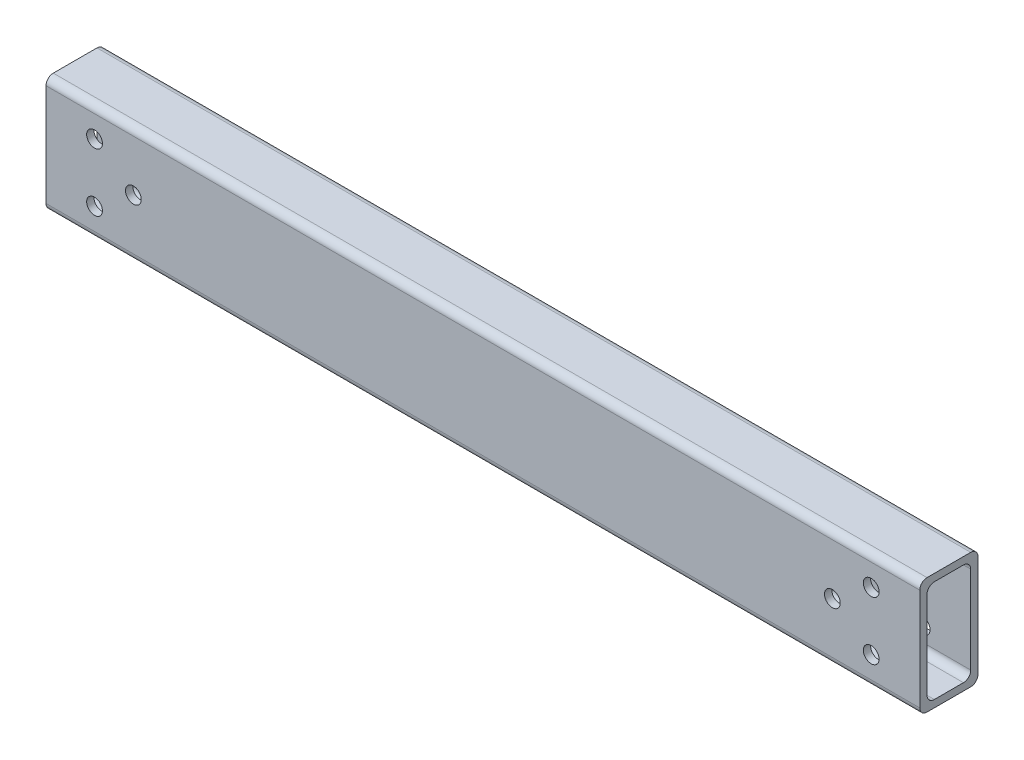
from build123d import *

# Parameters (mm, degrees)
SKETCH1_W               = 1143
SKETCH1_H               = 152.4
EXTRUDE1_DEPTH          = 76.2
SKETCH2_W               = 57.15
SKETCH2_H               = 133.35
CUT_EXTRUDE1_DEPTH      = 1143
FILLET1_R               = 9.525
SKETCH3_R               = 10.31875
CUT_EXTRUDE2_DEPTH      = 76.2
SKETCH6_R               = 10.31875
CUT_EXTRUDE3_DEPTH      = 76.2
MIRROR2_COPY_1_SKETCH_R = 10.31875
MIRROR2_COPY_1_DEPTH    = 76.2


with BuildPart() as part:
    # Sketch1 → Extrude1 (new body)
    with BuildSketch(Plane.XY):
        with Locations((-571.5, -76.2)):
            Rectangle(SKETCH1_W, SKETCH1_H)
    extrude(amount=EXTRUDE1_DEPTH)

    # Sketch2 → Cut-Extrude1 (cut)
    with BuildSketch(Plane(origin=(0, 0, 0), x_dir=(0, 0, -1), z_dir=(1, 0, 0))):
        with Locations((-38.1, -76.2)):
            Rectangle(SKETCH2_W, SKETCH2_H)
    extrude(amount=-CUT_EXTRUDE1_DEPTH, mode=Mode.SUBTRACT)

    # Fillet1
    fillet1_edges = [part.edges().sort_by_distance(p)[0] for p in [
        (-571.5, -152.4, 76.2),
        (-571.5, -142.875, 66.675),
        (-571.5, -9.525, 66.675),
        (-571.5, -9.525, 9.525),
        (-571.5, -142.875, 9.525),
        (-571.5, -152.4, 0),
        (-571.5, 0, 0),
        (-571.5, 0, 76.2),
    ]]
    fillet(fillet1_edges, radius=FILLET1_R)

    # Sketch3 → Cut-Extrude2 (cut)
    with BuildSketch(Plane(origin=(0, 0, 0), x_dir=(-1, 0, 0), z_dir=(0, 0, -1))):
        with Locations((63.5, -38.1)):
            Circle(SKETCH3_R)
    cut_extrude2 = extrude(amount=-CUT_EXTRUDE2_DEPTH, mode=Mode.SUBTRACT)

    # Mirror1: Cut-Extrude2 across plane
    add(cut_extrude2.mirror(Plane.ZX.offset(-76.2)), mode=Mode.SUBTRACT)

    # Sketch6 → Cut-Extrude3 (cut)
    with BuildSketch(Plane(origin=(0, 0, 0), x_dir=(-1, 0, 0), z_dir=(0, 0, -1))):
        with Locations((114.3, -76.2)):
            Circle(SKETCH6_R)
    cut_extrude3 = extrude(amount=-CUT_EXTRUDE3_DEPTH, mode=Mode.SUBTRACT)

    # Mirror2: Cut-Extrude2, Cut-Extrude3 across plane
    add(cut_extrude2.mirror(Plane(origin=(-571.5, 0, 0), x_dir=(0, 0, 1), z_dir=(1, 0, 0))), mode=Mode.SUBTRACT)
    add(cut_extrude3.mirror(Plane(origin=(-571.5, 0, 0), x_dir=(0, 0, 1), z_dir=(1, 0, 0))), mode=Mode.SUBTRACT)

    # Mirror2 copy 1 sketch → Mirror2 copy 1 (cut)
    with BuildSketch(Plane(origin=(-1143, -152.4, 0), x_dir=(1, 0, 0), z_dir=(0, 0, -1))):
        with Locations((63.5, -38.1)):
            Circle(MIRROR2_COPY_1_SKETCH_R)
    extrude(amount=-MIRROR2_COPY_1_DEPTH, mode=Mode.SUBTRACT)


solid = part.part
